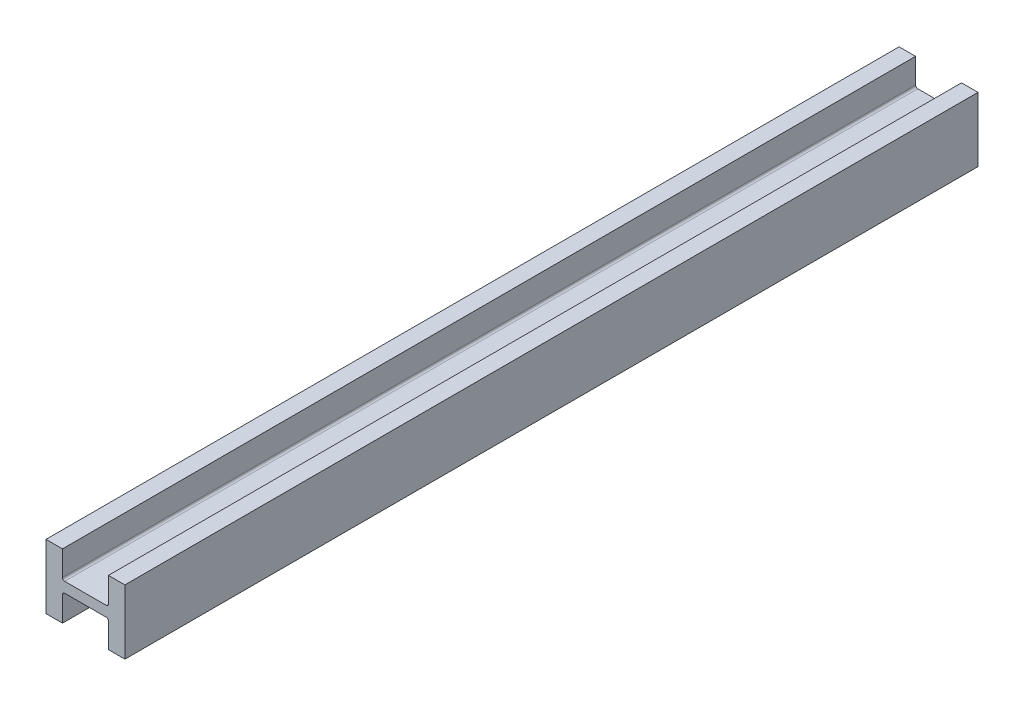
ISO-10303-21;
HEADER;
FILE_DESCRIPTION(('STEP AP214'),'2;1');
FILE_NAME('part.step','',(''),(''),'','','');
FILE_SCHEMA(('AUTOMOTIVE_DESIGN { 1 0 10303 214 1 1 1 1 }'));
ENDSEC;
DATA;
#1=APPLICATION_CONTEXT('core data for automotive mechanical design processes');
#2=APPLICATION_PROTOCOL_DEFINITION('international standard','automotive_design',2000,#1);
#3=PRODUCT_CONTEXT('',#1,'mechanical');
#4=PRODUCT('Part','Part','',(#3));
#5=PRODUCT_RELATED_PRODUCT_CATEGORY('part','',(#4));
#6=PRODUCT_DEFINITION_FORMATION('','',#4);
#7=PRODUCT_DEFINITION_CONTEXT('part definition',#1,'design');
#8=PRODUCT_DEFINITION('design','',#6,#7);
#9=PRODUCT_DEFINITION_SHAPE('','',#8);
#10=(LENGTH_UNIT() NAMED_UNIT(*) SI_UNIT(.MILLI.,.METRE.));
#11=(NAMED_UNIT(*) PLANE_ANGLE_UNIT() SI_UNIT($,.RADIAN.));
#12=(NAMED_UNIT(*) SI_UNIT($,.STERADIAN.) SOLID_ANGLE_UNIT());
#13=UNCERTAINTY_MEASURE_WITH_UNIT(LENGTH_MEASURE(1.E-05),#10,'distance_accuracy_value','');
#14=(GEOMETRIC_REPRESENTATION_CONTEXT(3) GLOBAL_UNCERTAINTY_ASSIGNED_CONTEXT((#13)) GLOBAL_UNIT_ASSIGNED_CONTEXT((#10,
#11,#12)) REPRESENTATION_CONTEXT('',''));
#15=CARTESIAN_POINT('',(0.,0.,0.));
#16=DIRECTION('',(0.,0.,1.));
#17=DIRECTION('',(1.,0.,0.));
#18=AXIS2_PLACEMENT_3D('',#15,#16,#17);
#19=CARTESIAN_POINT('',(274.828,224.155,2971.8));
#20=DIRECTION('',(-1.,0.,0.));
#21=DIRECTION('',(0.,0.,1.));
#22=AXIS2_PLACEMENT_3D('',#19,#20,#21);
#23=PLANE('',#22);
#24=DIRECTION('',(0.,1.,0.));
#25=VECTOR('',#24,1.);
#26=CARTESIAN_POINT('',(274.828,224.155,-2971.8));
#27=LINE('',#26,#25);
#28=CARTESIAN_POINT('',(274.828,-224.155,-2971.8));
#29=VERTEX_POINT('',#28);
#30=CARTESIAN_POINT('',(274.828,224.155,-2971.8));
#31=VERTEX_POINT('',#30);
#32=EDGE_CURVE('E198',#29,#31,#27,.T.);
#33=ORIENTED_EDGE('',*,*,#32,.T.);
#34=DIRECTION('',(0.,0.,-1.));
#35=VECTOR('',#34,1.);
#36=CARTESIAN_POINT('',(274.828,224.155,2971.8));
#37=LINE('',#36,#35);
#38=CARTESIAN_POINT('',(274.828,224.155,2971.8));
#39=VERTEX_POINT('',#38);
#40=EDGE_CURVE('E11',#39,#31,#37,.T.);
#41=ORIENTED_EDGE('',*,*,#40,.F.);
#42=DIRECTION('',(0.,1.,0.));
#43=VECTOR('',#42,1.);
#44=CARTESIAN_POINT('',(274.828,224.155,2971.8));
#45=LINE('',#44,#43);
#46=CARTESIAN_POINT('',(274.828,-224.155,2971.8));
#47=VERTEX_POINT('',#46);
#48=EDGE_CURVE('E245',#47,#39,#45,.T.);
#49=ORIENTED_EDGE('',*,*,#48,.F.);
#50=DIRECTION('',(0.,0.,-1.));
#51=VECTOR('',#50,1.);
#52=CARTESIAN_POINT('',(274.828,-224.155,2971.8));
#53=LINE('',#52,#51);
#54=EDGE_CURVE('E195',#47,#29,#53,.T.);
#55=ORIENTED_EDGE('',*,*,#54,.T.);
#56=EDGE_LOOP('',(#33,#41,#49,#55));
#57=FACE_BOUND('',#56,.T.);
#58=ADVANCED_FACE('F50',(#57),#23,.F.);
#59=CARTESIAN_POINT('',(160.02,224.155,2971.8));
#60=DIRECTION('',(0.,-1.,0.));
#61=DIRECTION('',(0.,0.,-1.));
#62=AXIS2_PLACEMENT_3D('',#59,#60,#61);
#63=PLANE('',#62);
#64=DIRECTION('',(-1.,0.,0.));
#65=VECTOR('',#64,1.);
#66=CARTESIAN_POINT('',(160.02,224.155,-2971.8));
#67=LINE('',#66,#65);
#68=CARTESIAN_POINT('',(160.02,224.155,-2971.8));
#69=VERTEX_POINT('',#68);
#70=EDGE_CURVE('E199',#31,#69,#67,.T.);
#71=ORIENTED_EDGE('',*,*,#70,.T.);
#72=DIRECTION('',(0.,0.,-1.));
#73=VECTOR('',#72,1.);
#74=CARTESIAN_POINT('',(160.02,224.155,2971.8));
#75=LINE('',#74,#73);
#76=CARTESIAN_POINT('',(160.02,224.155,2971.8));
#77=VERTEX_POINT('',#76);
#78=EDGE_CURVE('E57',#77,#69,#75,.T.);
#79=ORIENTED_EDGE('',*,*,#78,.F.);
#80=DIRECTION('',(-1.,0.,0.));
#81=VECTOR('',#80,1.);
#82=CARTESIAN_POINT('',(160.02,224.155,2971.8));
#83=LINE('',#82,#81);
#84=EDGE_CURVE('E131',#39,#77,#83,.T.);
#85=ORIENTED_EDGE('',*,*,#84,.F.);
#86=ORIENTED_EDGE('',*,*,#40,.T.);
#87=EDGE_LOOP('',(#71,#79,#85,#86));
#88=FACE_BOUND('',#87,.T.);
#89=ADVANCED_FACE('F365',(#88),#63,.F.);
#90=CARTESIAN_POINT('',(160.02,51.1810000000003,2971.8));
#91=DIRECTION('',(1.,0.,0.));
#92=DIRECTION('',(0.,0.,-1.));
#93=AXIS2_PLACEMENT_3D('',#90,#91,#92);
#94=PLANE('',#93);
#95=DIRECTION('',(0.,-1.,0.));
#96=VECTOR('',#95,1.);
#97=CARTESIAN_POINT('',(160.02,51.1810000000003,-2971.8));
#98=LINE('',#97,#96);
#99=CARTESIAN_POINT('',(160.02,51.1810000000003,-2971.8));
#100=VERTEX_POINT('',#99);
#101=EDGE_CURVE('E201',#69,#100,#98,.T.);
#102=ORIENTED_EDGE('',*,*,#101,.T.);
#103=DIRECTION('',(0.,0.,-1.));
#104=VECTOR('',#103,1.);
#105=CARTESIAN_POINT('',(160.02,51.1810000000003,2971.8));
#106=LINE('',#105,#104);
#107=CARTESIAN_POINT('',(160.02,51.1810000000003,2971.8));
#108=VERTEX_POINT('',#107);
#109=EDGE_CURVE('E284',#108,#100,#106,.T.);
#110=ORIENTED_EDGE('',*,*,#109,.F.);
#111=DIRECTION('',(0.,-1.,0.));
#112=VECTOR('',#111,1.);
#113=CARTESIAN_POINT('',(160.02,51.1810000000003,2971.8));
#114=LINE('',#113,#112);
#115=EDGE_CURVE('E293',#77,#108,#114,.T.);
#116=ORIENTED_EDGE('',*,*,#115,.F.);
#117=ORIENTED_EDGE('',*,*,#78,.T.);
#118=EDGE_LOOP('',(#102,#110,#116,#117));
#119=FACE_BOUND('',#118,.T.);
#120=ADVANCED_FACE('F291',(#119),#94,.F.);
#121=CARTESIAN_POINT('',(144.78,51.1810000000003,2971.8));
#122=DIRECTION('',(0.,0.,-1.));
#123=DIRECTION('',(-1.,0.,0.));
#124=AXIS2_PLACEMENT_3D('',#121,#122,#123);
#125=CYLINDRICAL_SURFACE('',#124,15.24);
#126=CARTESIAN_POINT('',(144.78,51.1810000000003,-2971.8));
#127=DIRECTION('',(0.,0.,-1.));
#128=DIRECTION('',(1.,0.,0.));
#129=AXIS2_PLACEMENT_3D('',#126,#127,#128);
#130=CIRCLE('',#129,15.24);
#131=CARTESIAN_POINT('',(144.78,35.9410000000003,-2971.8));
#132=VERTEX_POINT('',#131);
#133=EDGE_CURVE('E206',#100,#132,#130,.T.);
#134=ORIENTED_EDGE('',*,*,#133,.T.);
#135=DIRECTION('',(0.,0.,-1.));
#136=VECTOR('',#135,1.);
#137=CARTESIAN_POINT('',(144.78,35.9410000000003,2971.8));
#138=LINE('',#137,#136);
#139=CARTESIAN_POINT('',(144.78,35.9410000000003,2971.8));
#140=VERTEX_POINT('',#139);
#141=EDGE_CURVE('E281',#140,#132,#138,.T.);
#142=ORIENTED_EDGE('',*,*,#141,.F.);
#143=CARTESIAN_POINT('',(144.78,51.1810000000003,2971.8));
#144=DIRECTION('',(0.,0.,-1.));
#145=DIRECTION('',(1.,0.,0.));
#146=AXIS2_PLACEMENT_3D('',#143,#144,#145);
#147=CIRCLE('',#146,15.24);
#148=EDGE_CURVE('E314',#108,#140,#147,.T.);
#149=ORIENTED_EDGE('',*,*,#148,.F.);
#150=ORIENTED_EDGE('',*,*,#109,.T.);
#151=EDGE_LOOP('',(#134,#142,#149,#150));
#152=FACE_BOUND('',#151,.T.);
#153=ADVANCED_FACE('F303',(#152),#125,.F.);
#154=CARTESIAN_POINT('',(-144.78,35.9410000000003,2971.8));
#155=DIRECTION('',(0.,-1.,0.));
#156=DIRECTION('',(1.,0.,0.));
#157=AXIS2_PLACEMENT_3D('',#154,#155,#156);
#158=PLANE('',#157);
#159=DIRECTION('',(-1.,0.,0.));
#160=VECTOR('',#159,1.);
#161=CARTESIAN_POINT('',(-144.78,35.9410000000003,-2971.8));
#162=LINE('',#161,#160);
#163=CARTESIAN_POINT('',(-144.78,35.9410000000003,-2971.8));
#164=VERTEX_POINT('',#163);
#165=EDGE_CURVE('E207',#132,#164,#162,.T.);
#166=ORIENTED_EDGE('',*,*,#165,.T.);
#167=DIRECTION('',(0.,0.,-1.));
#168=VECTOR('',#167,1.);
#169=CARTESIAN_POINT('',(-144.78,35.9410000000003,2971.8));
#170=LINE('',#169,#168);
#171=CARTESIAN_POINT('',(-144.78,35.9410000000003,2971.8));
#172=VERTEX_POINT('',#171);
#173=EDGE_CURVE('E280',#172,#164,#170,.T.);
#174=ORIENTED_EDGE('',*,*,#173,.F.);
#175=DIRECTION('',(-1.,0.,0.));
#176=VECTOR('',#175,1.);
#177=CARTESIAN_POINT('',(-144.78,35.9410000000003,2971.8));
#178=LINE('',#177,#176);
#179=EDGE_CURVE('E309',#140,#172,#178,.T.);
#180=ORIENTED_EDGE('',*,*,#179,.F.);
#181=ORIENTED_EDGE('',*,*,#141,.T.);
#182=EDGE_LOOP('',(#166,#174,#180,#181));
#183=FACE_BOUND('',#182,.T.);
#184=ADVANCED_FACE('F306',(#183),#158,.F.);
#185=CARTESIAN_POINT('',(-144.78,51.1810000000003,2971.8));
#186=DIRECTION('',(0.,0.,-1.));
#187=DIRECTION('',(-1.,0.,0.));
#188=AXIS2_PLACEMENT_3D('',#185,#186,#187);
#189=CYLINDRICAL_SURFACE('',#188,15.24);
#190=CARTESIAN_POINT('',(-144.78,51.1810000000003,-2971.8));
#191=DIRECTION('',(0.,0.,-1.));
#192=DIRECTION('',(1.,0.,0.));
#193=AXIS2_PLACEMENT_3D('',#190,#191,#192);
#194=CIRCLE('',#193,15.24);
#195=CARTESIAN_POINT('',(-160.02,51.1810000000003,-2971.8));
#196=VERTEX_POINT('',#195);
#197=EDGE_CURVE('E215',#164,#196,#194,.T.);
#198=ORIENTED_EDGE('',*,*,#197,.T.);
#199=DIRECTION('',(0.,0.,-1.));
#200=VECTOR('',#199,1.);
#201=CARTESIAN_POINT('',(-160.02,51.1810000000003,2971.8));
#202=LINE('',#201,#200);
#203=CARTESIAN_POINT('',(-160.02,51.1810000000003,2971.8));
#204=VERTEX_POINT('',#203);
#205=EDGE_CURVE('E272',#204,#196,#202,.T.);
#206=ORIENTED_EDGE('',*,*,#205,.F.);
#207=CARTESIAN_POINT('',(-144.78,51.1810000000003,2971.8));
#208=DIRECTION('',(0.,0.,-1.));
#209=DIRECTION('',(1.,0.,0.));
#210=AXIS2_PLACEMENT_3D('',#207,#208,#209);
#211=CIRCLE('',#210,15.24);
#212=EDGE_CURVE('E311',#172,#204,#211,.T.);
#213=ORIENTED_EDGE('',*,*,#212,.F.);
#214=ORIENTED_EDGE('',*,*,#173,.T.);
#215=EDGE_LOOP('',(#198,#206,#213,#214));
#216=FACE_BOUND('',#215,.T.);
#217=ADVANCED_FACE('F380',(#216),#189,.F.);
#218=CARTESIAN_POINT('',(-160.02,224.155,2971.8));
#219=DIRECTION('',(-1.,0.,0.));
#220=DIRECTION('',(0.,0.,1.));
#221=AXIS2_PLACEMENT_3D('',#218,#219,#220);
#222=PLANE('',#221);
#223=DIRECTION('',(0.,1.,0.));
#224=VECTOR('',#223,1.);
#225=CARTESIAN_POINT('',(-160.02,224.155,-2971.8));
#226=LINE('',#225,#224);
#227=CARTESIAN_POINT('',(-160.02,224.155,-2971.8));
#228=VERTEX_POINT('',#227);
#229=EDGE_CURVE('E214',#196,#228,#226,.T.);
#230=ORIENTED_EDGE('',*,*,#229,.T.);
#231=DIRECTION('',(0.,0.,-1.));
#232=VECTOR('',#231,1.);
#233=CARTESIAN_POINT('',(-160.02,224.155,2971.8));
#234=LINE('',#233,#232);
#235=CARTESIAN_POINT('',(-160.02,224.155,2971.8));
#236=VERTEX_POINT('',#235);
#237=EDGE_CURVE('E267',#236,#228,#234,.T.);
#238=ORIENTED_EDGE('',*,*,#237,.F.);
#239=DIRECTION('',(0.,1.,0.));
#240=VECTOR('',#239,1.);
#241=CARTESIAN_POINT('',(-160.02,224.155,2971.8));
#242=LINE('',#241,#240);
#243=EDGE_CURVE('E318',#204,#236,#242,.T.);
#244=ORIENTED_EDGE('',*,*,#243,.F.);
#245=ORIENTED_EDGE('',*,*,#205,.T.);
#246=EDGE_LOOP('',(#230,#238,#244,#245));
#247=FACE_BOUND('',#246,.T.);
#248=ADVANCED_FACE('F379',(#247),#222,.F.);
#249=CARTESIAN_POINT('',(-274.828,224.155,2971.8));
#250=DIRECTION('',(0.,-1.,0.));
#251=DIRECTION('',(0.,0.,-1.));
#252=AXIS2_PLACEMENT_3D('',#249,#250,#251);
#253=PLANE('',#252);
#254=DIRECTION('',(-1.,0.,0.));
#255=VECTOR('',#254,1.);
#256=CARTESIAN_POINT('',(-274.828,224.155,-2971.8));
#257=LINE('',#256,#255);
#258=CARTESIAN_POINT('',(-274.828,224.155,-2971.8));
#259=VERTEX_POINT('',#258);
#260=EDGE_CURVE('E217',#228,#259,#257,.T.);
#261=ORIENTED_EDGE('',*,*,#260,.T.);
#262=DIRECTION('',(0.,0.,-1.));
#263=VECTOR('',#262,1.);
#264=CARTESIAN_POINT('',(-274.828,224.155,2971.8));
#265=LINE('',#264,#263);
#266=CARTESIAN_POINT('',(-274.828,224.155,2971.8));
#267=VERTEX_POINT('',#266);
#268=EDGE_CURVE('E264',#267,#259,#265,.T.);
#269=ORIENTED_EDGE('',*,*,#268,.F.);
#270=DIRECTION('',(-1.,0.,0.));
#271=VECTOR('',#270,1.);
#272=CARTESIAN_POINT('',(-274.828,224.155,2971.8));
#273=LINE('',#272,#271);
#274=EDGE_CURVE('E324',#236,#267,#273,.T.);
#275=ORIENTED_EDGE('',*,*,#274,.F.);
#276=ORIENTED_EDGE('',*,*,#237,.T.);
#277=EDGE_LOOP('',(#261,#269,#275,#276));
#278=FACE_BOUND('',#277,.T.);
#279=ADVANCED_FACE('F383',(#278),#253,.F.);
#280=CARTESIAN_POINT('',(-274.828,-224.155,2971.8));
#281=DIRECTION('',(1.,0.,0.));
#282=DIRECTION('',(0.,0.,-1.));
#283=AXIS2_PLACEMENT_3D('',#280,#281,#282);
#284=PLANE('',#283);
#285=DIRECTION('',(0.,-1.,0.));
#286=VECTOR('',#285,1.);
#287=CARTESIAN_POINT('',(-274.828,-224.155,-2971.8));
#288=LINE('',#287,#286);
#289=CARTESIAN_POINT('',(-274.828,-224.155,-2971.8));
#290=VERTEX_POINT('',#289);
#291=EDGE_CURVE('E222',#259,#290,#288,.T.);
#292=ORIENTED_EDGE('',*,*,#291,.T.);
#293=DIRECTION('',(0.,0.,-1.));
#294=VECTOR('',#293,1.);
#295=CARTESIAN_POINT('',(-274.828,-224.155,2971.8));
#296=LINE('',#295,#294);
#297=CARTESIAN_POINT('',(-274.828,-224.155,2971.8));
#298=VERTEX_POINT('',#297);
#299=EDGE_CURVE('E261',#298,#290,#296,.T.);
#300=ORIENTED_EDGE('',*,*,#299,.F.);
#301=DIRECTION('',(0.,-1.,0.));
#302=VECTOR('',#301,1.);
#303=CARTESIAN_POINT('',(-274.828,-224.155,2971.8));
#304=LINE('',#303,#302);
#305=EDGE_CURVE('E327',#267,#298,#304,.T.);
#306=ORIENTED_EDGE('',*,*,#305,.F.);
#307=ORIENTED_EDGE('',*,*,#268,.T.);
#308=EDGE_LOOP('',(#292,#300,#306,#307));
#309=FACE_BOUND('',#308,.T.);
#310=ADVANCED_FACE('F389',(#309),#284,.F.);
#311=CARTESIAN_POINT('',(-160.02,-224.155,2971.8));
#312=DIRECTION('',(0.,1.,0.));
#313=DIRECTION('',(0.,0.,1.));
#314=AXIS2_PLACEMENT_3D('',#311,#312,#313);
#315=PLANE('',#314);
#316=DIRECTION('',(1.,0.,0.));
#317=VECTOR('',#316,1.);
#318=CARTESIAN_POINT('',(-160.02,-224.155,-2971.8));
#319=LINE('',#318,#317);
#320=CARTESIAN_POINT('',(-160.02,-224.155,-2971.8));
#321=VERTEX_POINT('',#320);
#322=EDGE_CURVE('E221',#290,#321,#319,.T.);
#323=ORIENTED_EDGE('',*,*,#322,.T.);
#324=DIRECTION('',(0.,0.,-1.));
#325=VECTOR('',#324,1.);
#326=CARTESIAN_POINT('',(-160.02,-224.155,2971.8));
#327=LINE('',#326,#325);
#328=CARTESIAN_POINT('',(-160.02,-224.155,2971.8));
#329=VERTEX_POINT('',#328);
#330=EDGE_CURVE('E260',#329,#321,#327,.T.);
#331=ORIENTED_EDGE('',*,*,#330,.F.);
#332=DIRECTION('',(1.,0.,0.));
#333=VECTOR('',#332,1.);
#334=CARTESIAN_POINT('',(-160.02,-224.155,2971.8));
#335=LINE('',#334,#333);
#336=EDGE_CURVE('E332',#298,#329,#335,.T.);
#337=ORIENTED_EDGE('',*,*,#336,.F.);
#338=ORIENTED_EDGE('',*,*,#299,.T.);
#339=EDGE_LOOP('',(#323,#331,#337,#338));
#340=FACE_BOUND('',#339,.T.);
#341=ADVANCED_FACE('F395',(#340),#315,.F.);
#342=CARTESIAN_POINT('',(-160.02,-51.1809999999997,2971.8));
#343=DIRECTION('',(-1.,0.,0.));
#344=DIRECTION('',(0.,-1.,0.));
#345=AXIS2_PLACEMENT_3D('',#342,#343,#344);
#346=PLANE('',#345);
#347=DIRECTION('',(0.,1.,0.));
#348=VECTOR('',#347,1.);
#349=CARTESIAN_POINT('',(-160.02,-51.1809999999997,-2971.8));
#350=LINE('',#349,#348);
#351=CARTESIAN_POINT('',(-160.02,-51.1809999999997,-2971.8));
#352=VERTEX_POINT('',#351);
#353=EDGE_CURVE('E230',#321,#352,#350,.T.);
#354=ORIENTED_EDGE('',*,*,#353,.T.);
#355=DIRECTION('',(0.,0.,-1.));
#356=VECTOR('',#355,1.);
#357=CARTESIAN_POINT('',(-160.02,-51.1809999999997,2971.8));
#358=LINE('',#357,#356);
#359=CARTESIAN_POINT('',(-160.02,-51.1809999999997,2971.8));
#360=VERTEX_POINT('',#359);
#361=EDGE_CURVE('E251',#360,#352,#358,.T.);
#362=ORIENTED_EDGE('',*,*,#361,.F.);
#363=DIRECTION('',(0.,1.,0.));
#364=VECTOR('',#363,1.);
#365=CARTESIAN_POINT('',(-160.02,-51.1809999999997,2971.8));
#366=LINE('',#365,#364);
#367=EDGE_CURVE('E331',#329,#360,#366,.T.);
#368=ORIENTED_EDGE('',*,*,#367,.F.);
#369=ORIENTED_EDGE('',*,*,#330,.T.);
#370=EDGE_LOOP('',(#354,#362,#368,#369));
#371=FACE_BOUND('',#370,.T.);
#372=ADVANCED_FACE('F396',(#371),#346,.F.);
#373=CARTESIAN_POINT('',(-144.78,-51.1809999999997,2971.8));
#374=DIRECTION('',(0.,0.,-1.));
#375=DIRECTION('',(-1.,0.,0.));
#376=AXIS2_PLACEMENT_3D('',#373,#374,#375);
#377=CYLINDRICAL_SURFACE('',#376,15.24);
#378=CARTESIAN_POINT('',(-144.78,-51.1809999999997,-2971.8));
#379=DIRECTION('',(0.,0.,-1.));
#380=DIRECTION('',(1.,0.,0.));
#381=AXIS2_PLACEMENT_3D('',#378,#379,#380);
#382=CIRCLE('',#381,15.24);
#383=CARTESIAN_POINT('',(-144.78,-35.9409999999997,-2971.8));
#384=VERTEX_POINT('',#383);
#385=EDGE_CURVE('E229',#352,#384,#382,.T.);
#386=ORIENTED_EDGE('',*,*,#385,.T.);
#387=DIRECTION('',(0.,0.,-1.));
#388=VECTOR('',#387,1.);
#389=CARTESIAN_POINT('',(-144.78,-35.9409999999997,2971.8));
#390=LINE('',#389,#388);
#391=CARTESIAN_POINT('',(-144.78,-35.9409999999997,2971.8));
#392=VERTEX_POINT('',#391);
#393=EDGE_CURVE('E248',#392,#384,#390,.T.);
#394=ORIENTED_EDGE('',*,*,#393,.F.);
#395=CARTESIAN_POINT('',(-144.78,-51.1809999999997,2971.8));
#396=DIRECTION('',(0.,0.,-1.));
#397=DIRECTION('',(1.,0.,0.));
#398=AXIS2_PLACEMENT_3D('',#395,#396,#397);
#399=CIRCLE('',#398,15.24);
#400=EDGE_CURVE('E340',#360,#392,#399,.T.);
#401=ORIENTED_EDGE('',*,*,#400,.F.);
#402=ORIENTED_EDGE('',*,*,#361,.T.);
#403=EDGE_LOOP('',(#386,#394,#401,#402));
#404=FACE_BOUND('',#403,.T.);
#405=ADVANCED_FACE('F344',(#404),#377,.F.);
#406=CARTESIAN_POINT('',(144.78,-35.9409999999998,2971.8));
#407=DIRECTION('',(0.,1.,0.));
#408=DIRECTION('',(-1.,0.,0.));
#409=AXIS2_PLACEMENT_3D('',#406,#407,#408);
#410=PLANE('',#409);
#411=DIRECTION('',(1.,0.,0.));
#412=VECTOR('',#411,1.);
#413=CARTESIAN_POINT('',(144.78,-35.9409999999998,-2971.8));
#414=LINE('',#413,#412);
#415=CARTESIAN_POINT('',(144.78,-35.9409999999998,-2971.8));
#416=VERTEX_POINT('',#415);
#417=EDGE_CURVE('E232',#384,#416,#414,.T.);
#418=ORIENTED_EDGE('',*,*,#417,.T.);
#419=DIRECTION('',(0.,0.,-1.));
#420=VECTOR('',#419,1.);
#421=CARTESIAN_POINT('',(144.78,-35.9409999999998,2971.8));
#422=LINE('',#421,#420);
#423=CARTESIAN_POINT('',(144.78,-35.9409999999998,2971.8));
#424=VERTEX_POINT('',#423);
#425=EDGE_CURVE('E183',#424,#416,#422,.T.);
#426=ORIENTED_EDGE('',*,*,#425,.F.);
#427=DIRECTION('',(1.,0.,0.));
#428=VECTOR('',#427,1.);
#429=CARTESIAN_POINT('',(144.78,-35.9409999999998,2971.8));
#430=LINE('',#429,#428);
#431=EDGE_CURVE('E173',#392,#424,#430,.T.);
#432=ORIENTED_EDGE('',*,*,#431,.F.);
#433=ORIENTED_EDGE('',*,*,#393,.T.);
#434=EDGE_LOOP('',(#418,#426,#432,#433));
#435=FACE_BOUND('',#434,.T.);
#436=ADVANCED_FACE('F349',(#435),#410,.F.);
#437=CARTESIAN_POINT('',(144.78,-51.1809999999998,2971.8));
#438=DIRECTION('',(0.,0.,-1.));
#439=DIRECTION('',(-1.,0.,0.));
#440=AXIS2_PLACEMENT_3D('',#437,#438,#439);
#441=CYLINDRICAL_SURFACE('',#440,15.24);
#442=CARTESIAN_POINT('',(144.78,-51.1809999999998,-2971.8));
#443=DIRECTION('',(0.,0.,-1.));
#444=DIRECTION('',(1.,0.,0.));
#445=AXIS2_PLACEMENT_3D('',#442,#443,#444);
#446=CIRCLE('',#445,15.24);
#447=CARTESIAN_POINT('',(160.02,-51.1809999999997,-2971.8));
#448=VERTEX_POINT('',#447);
#449=EDGE_CURVE('E181',#416,#448,#446,.T.);
#450=ORIENTED_EDGE('',*,*,#449,.T.);
#451=DIRECTION('',(0.,0.,-1.));
#452=VECTOR('',#451,1.);
#453=CARTESIAN_POINT('',(160.02,-51.1809999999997,2971.8));
#454=LINE('',#453,#452);
#455=CARTESIAN_POINT('',(160.02,-51.1809999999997,2971.8));
#456=VERTEX_POINT('',#455);
#457=EDGE_CURVE('E179',#456,#448,#454,.T.);
#458=ORIENTED_EDGE('',*,*,#457,.F.);
#459=CARTESIAN_POINT('',(144.78,-51.1809999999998,2971.8));
#460=DIRECTION('',(0.,0.,-1.));
#461=DIRECTION('',(1.,0.,0.));
#462=AXIS2_PLACEMENT_3D('',#459,#460,#461);
#463=CIRCLE('',#462,15.24);
#464=EDGE_CURVE('E169',#424,#456,#463,.T.);
#465=ORIENTED_EDGE('',*,*,#464,.F.);
#466=ORIENTED_EDGE('',*,*,#425,.T.);
#467=EDGE_LOOP('',(#450,#458,#465,#466));
#468=FACE_BOUND('',#467,.T.);
#469=ADVANCED_FACE('F182',(#468),#441,.F.);
#470=CARTESIAN_POINT('',(160.02,-224.155,2971.8));
#471=DIRECTION('',(1.,0.,0.));
#472=DIRECTION('',(0.,0.,-1.));
#473=AXIS2_PLACEMENT_3D('',#470,#471,#472);
#474=PLANE('',#473);
#475=DIRECTION('',(0.,-1.,0.));
#476=VECTOR('',#475,1.);
#477=CARTESIAN_POINT('',(160.02,-224.155,-2971.8));
#478=LINE('',#477,#476);
#479=CARTESIAN_POINT('',(160.02,-224.155,-2971.8));
#480=VERTEX_POINT('',#479);
#481=EDGE_CURVE('E120',#448,#480,#478,.T.);
#482=ORIENTED_EDGE('',*,*,#481,.T.);
#483=DIRECTION('',(0.,0.,-1.));
#484=VECTOR('',#483,1.);
#485=CARTESIAN_POINT('',(160.02,-224.155,2971.8));
#486=LINE('',#485,#484);
#487=CARTESIAN_POINT('',(160.02,-224.155,2971.8));
#488=VERTEX_POINT('',#487);
#489=EDGE_CURVE('E186',#488,#480,#486,.T.);
#490=ORIENTED_EDGE('',*,*,#489,.F.);
#491=DIRECTION('',(0.,-1.,0.));
#492=VECTOR('',#491,1.);
#493=CARTESIAN_POINT('',(160.02,-224.155,2971.8));
#494=LINE('',#493,#492);
#495=EDGE_CURVE('E175',#456,#488,#494,.T.);
#496=ORIENTED_EDGE('',*,*,#495,.F.);
#497=ORIENTED_EDGE('',*,*,#457,.T.);
#498=EDGE_LOOP('',(#482,#490,#496,#497));
#499=FACE_BOUND('',#498,.T.);
#500=ADVANCED_FACE('F187',(#499),#474,.F.);
#501=CARTESIAN_POINT('',(274.828,-224.155,2971.8));
#502=DIRECTION('',(0.,1.,0.));
#503=DIRECTION('',(0.,0.,1.));
#504=AXIS2_PLACEMENT_3D('',#501,#502,#503);
#505=PLANE('',#504);
#506=DIRECTION('',(1.,0.,0.));
#507=VECTOR('',#506,1.);
#508=CARTESIAN_POINT('',(274.828,-224.155,-2971.8));
#509=LINE('',#508,#507);
#510=EDGE_CURVE('E122',#480,#29,#509,.T.);
#511=ORIENTED_EDGE('',*,*,#510,.T.);
#512=ORIENTED_EDGE('',*,*,#54,.F.);
#513=DIRECTION('',(1.,0.,0.));
#514=VECTOR('',#513,1.);
#515=CARTESIAN_POINT('',(274.828,-224.155,2971.8));
#516=LINE('',#515,#514);
#517=EDGE_CURVE('E63',#488,#47,#516,.T.);
#518=ORIENTED_EDGE('',*,*,#517,.F.);
#519=ORIENTED_EDGE('',*,*,#489,.T.);
#520=EDGE_LOOP('',(#511,#512,#518,#519));
#521=FACE_BOUND('',#520,.T.);
#522=ADVANCED_FACE('F352',(#521),#505,.F.);
#523=CARTESIAN_POINT('',(144.78,-51.1809999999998,2971.8));
#524=DIRECTION('',(0.,0.,1.));
#525=DIRECTION('',(1.,0.,0.));
#526=AXIS2_PLACEMENT_3D('',#523,#524,#525);
#527=PLANE('',#526);
#528=ORIENTED_EDGE('',*,*,#48,.T.);
#529=ORIENTED_EDGE('',*,*,#84,.T.);
#530=ORIENTED_EDGE('',*,*,#115,.T.);
#531=ORIENTED_EDGE('',*,*,#148,.T.);
#532=ORIENTED_EDGE('',*,*,#179,.T.);
#533=ORIENTED_EDGE('',*,*,#212,.T.);
#534=ORIENTED_EDGE('',*,*,#243,.T.);
#535=ORIENTED_EDGE('',*,*,#274,.T.);
#536=ORIENTED_EDGE('',*,*,#305,.T.);
#537=ORIENTED_EDGE('',*,*,#336,.T.);
#538=ORIENTED_EDGE('',*,*,#367,.T.);
#539=ORIENTED_EDGE('',*,*,#400,.T.);
#540=ORIENTED_EDGE('',*,*,#431,.T.);
#541=ORIENTED_EDGE('',*,*,#464,.T.);
#542=ORIENTED_EDGE('',*,*,#495,.T.);
#543=ORIENTED_EDGE('',*,*,#517,.T.);
#544=EDGE_LOOP('',(#528,#529,#530,#531,#532,#533,#534,#535,#536,#537,#538,#539,#540,#541,#542,#543));
#545=FACE_BOUND('',#544,.T.);
#546=ADVANCED_FACE('F168',(#545),#527,.T.);
#547=CARTESIAN_POINT('',(144.78,-51.1809999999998,-2971.8));
#548=DIRECTION('',(0.,0.,1.));
#549=DIRECTION('',(1.,0.,0.));
#550=AXIS2_PLACEMENT_3D('',#547,#548,#549);
#551=PLANE('',#550);
#552=ORIENTED_EDGE('',*,*,#32,.F.);
#553=ORIENTED_EDGE('',*,*,#510,.F.);
#554=ORIENTED_EDGE('',*,*,#481,.F.);
#555=ORIENTED_EDGE('',*,*,#449,.F.);
#556=ORIENTED_EDGE('',*,*,#417,.F.);
#557=ORIENTED_EDGE('',*,*,#385,.F.);
#558=ORIENTED_EDGE('',*,*,#353,.F.);
#559=ORIENTED_EDGE('',*,*,#322,.F.);
#560=ORIENTED_EDGE('',*,*,#291,.F.);
#561=ORIENTED_EDGE('',*,*,#260,.F.);
#562=ORIENTED_EDGE('',*,*,#229,.F.);
#563=ORIENTED_EDGE('',*,*,#197,.F.);
#564=ORIENTED_EDGE('',*,*,#165,.F.);
#565=ORIENTED_EDGE('',*,*,#133,.F.);
#566=ORIENTED_EDGE('',*,*,#101,.F.);
#567=ORIENTED_EDGE('',*,*,#70,.F.);
#568=EDGE_LOOP('',(#552,#553,#554,#555,#556,#557,#558,#559,#560,#561,#562,#563,#564,#565,#566,#567));
#569=FACE_BOUND('',#568,.T.);
#570=ADVANCED_FACE('F298',(#569),#551,.F.);
#571=CLOSED_SHELL('',(#58,#89,#120,#153,#184,#217,#248,#279,#310,#341,#372,#405,#436,#469,#500,
#522,#546,#570));
#572=MANIFOLD_SOLID_BREP('B2',#571);
#573=ADVANCED_BREP_SHAPE_REPRESENTATION('',(#18,#572),#14);
#574=SHAPE_DEFINITION_REPRESENTATION(#9,#573);
ENDSEC;
END-ISO-10303-21;
